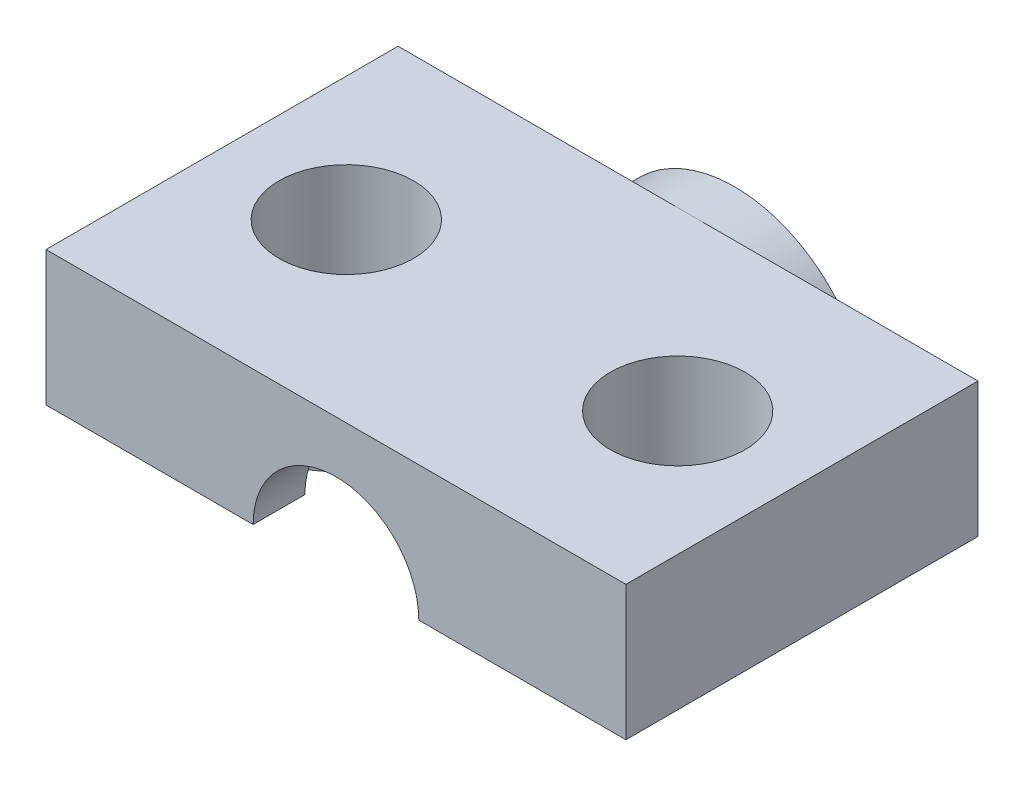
ISO-10303-21;
HEADER;
FILE_DESCRIPTION(('STEP AP214'),'2;1');
FILE_NAME('part.step','',(''),(''),'','','');
FILE_SCHEMA(('AUTOMOTIVE_DESIGN { 1 0 10303 214 1 1 1 1 }'));
ENDSEC;
DATA;
#1=APPLICATION_CONTEXT('core data for automotive mechanical design processes');
#2=APPLICATION_PROTOCOL_DEFINITION('international standard','automotive_design',2000,#1);
#3=PRODUCT_CONTEXT('',#1,'mechanical');
#4=PRODUCT('Part','Part','',(#3));
#5=PRODUCT_RELATED_PRODUCT_CATEGORY('part','',(#4));
#6=PRODUCT_DEFINITION_FORMATION('','',#4);
#7=PRODUCT_DEFINITION_CONTEXT('part definition',#1,'design');
#8=PRODUCT_DEFINITION('design','',#6,#7);
#9=PRODUCT_DEFINITION_SHAPE('','',#8);
#10=(LENGTH_UNIT() NAMED_UNIT(*) SI_UNIT(.MILLI.,.METRE.));
#11=(NAMED_UNIT(*) PLANE_ANGLE_UNIT() SI_UNIT($,.RADIAN.));
#12=(NAMED_UNIT(*) SI_UNIT($,.STERADIAN.) SOLID_ANGLE_UNIT());
#13=UNCERTAINTY_MEASURE_WITH_UNIT(LENGTH_MEASURE(1.E-05),#10,'distance_accuracy_value','');
#14=(GEOMETRIC_REPRESENTATION_CONTEXT(3) GLOBAL_UNCERTAINTY_ASSIGNED_CONTEXT((#13)) GLOBAL_UNIT_ASSIGNED_CONTEXT((#10,
#11,#12)) REPRESENTATION_CONTEXT('',''));
#15=CARTESIAN_POINT('',(0.,0.,0.));
#16=DIRECTION('',(0.,0.,1.));
#17=DIRECTION('',(1.,0.,0.));
#18=AXIS2_PLACEMENT_3D('',#15,#16,#17);
#19=CARTESIAN_POINT('',(-14.,6.5,-8.5));
#20=DIRECTION('',(0.,0.,1.));
#21=DIRECTION('',(1.,0.,0.));
#22=AXIS2_PLACEMENT_3D('',#19,#20,#21);
#23=PLANE('',#22);
#24=CARTESIAN_POINT('',(0.,0.,-8.5));
#25=DIRECTION('',(0.,0.,-1.));
#26=DIRECTION('',(-1.,0.,0.));
#27=AXIS2_PLACEMENT_3D('',#24,#25,#26);
#28=CIRCLE('',#27,6.5);
#29=CARTESIAN_POINT('',(-6.5,0.,-8.5));
#30=VERTEX_POINT('',#29);
#31=CARTESIAN_POINT('',(0.,6.5,-8.5));
#32=VERTEX_POINT('',#31);
#33=EDGE_CURVE('E46',#30,#32,#28,.T.);
#34=ORIENTED_EDGE('',*,*,#33,.F.);
#35=DIRECTION('',(-1.,0.,0.));
#36=VECTOR('',#35,1.);
#37=CARTESIAN_POINT('',(-14.,0.,-8.5));
#38=LINE('',#37,#36);
#39=CARTESIAN_POINT('',(-14.,0.,-8.5));
#40=VERTEX_POINT('',#39);
#41=EDGE_CURVE('E373',#30,#40,#38,.T.);
#42=ORIENTED_EDGE('',*,*,#41,.T.);
#43=DIRECTION('',(0.,-1.,0.));
#44=VECTOR('',#43,1.);
#45=CARTESIAN_POINT('',(-14.,6.5,-8.5));
#46=LINE('',#45,#44);
#47=CARTESIAN_POINT('',(-14.,6.5,-8.5));
#48=VERTEX_POINT('',#47);
#49=EDGE_CURVE('E396',#48,#40,#46,.T.);
#50=ORIENTED_EDGE('',*,*,#49,.F.);
#51=DIRECTION('',(-1.,0.,0.));
#52=VECTOR('',#51,1.);
#53=CARTESIAN_POINT('',(-14.,6.5,-8.5));
#54=LINE('',#53,#52);
#55=EDGE_CURVE('E508',#32,#48,#54,.T.);
#56=ORIENTED_EDGE('',*,*,#55,.F.);
#57=EDGE_LOOP('',(#34,#42,#50,#56));
#58=FACE_BOUND('',#57,.T.);
#59=ADVANCED_FACE('F35',(#58),#23,.F.);
#60=CARTESIAN_POINT('',(0.,0.,0.));
#61=DIRECTION('',(0.,1.,0.));
#62=DIRECTION('',(0.,0.,1.));
#63=AXIS2_PLACEMENT_3D('',#60,#61,#62);
#64=PLANE('',#63);
#65=CARTESIAN_POINT('',(-8.,0.,0.));
#66=DIRECTION('',(0.,-1.,0.));
#67=DIRECTION('',(0.,0.,-1.));
#68=AXIS2_PLACEMENT_3D('',#65,#66,#67);
#69=CIRCLE('',#68,3.25);
#70=CARTESIAN_POINT('',(-8.,0.,-3.25));
#71=VERTEX_POINT('',#70);
#72=EDGE_CURVE('E379',#71,#71,#69,.T.);
#73=ORIENTED_EDGE('',*,*,#72,.F.);
#74=EDGE_LOOP('',(#73));
#75=FACE_BOUND('',#74,.T.);
#76=ORIENTED_EDGE('',*,*,#41,.F.);
#77=DIRECTION('',(0.,0.,1.));
#78=VECTOR('',#77,1.);
#79=CARTESIAN_POINT('',(-6.5,0.,-10.75));
#80=LINE('',#79,#78);
#81=CARTESIAN_POINT('',(-6.5,0.,-10.75));
#82=VERTEX_POINT('',#81);
#83=EDGE_CURVE('E228',#82,#30,#80,.T.);
#84=ORIENTED_EDGE('',*,*,#83,.F.);
#85=DIRECTION('',(-1.,0.,0.));
#86=VECTOR('',#85,1.);
#87=CARTESIAN_POINT('',(-6.5,0.,-10.75));
#88=LINE('',#87,#86);
#89=CARTESIAN_POINT('',(-4.,0.,-10.75));
#90=VERTEX_POINT('',#89);
#91=EDGE_CURVE('E225',#90,#82,#88,.T.);
#92=ORIENTED_EDGE('',*,*,#91,.F.);
#93=DIRECTION('',(0.,0.,1.));
#94=VECTOR('',#93,1.);
#95=CARTESIAN_POINT('',(-4.,0.,-8.5));
#96=LINE('',#95,#94);
#97=CARTESIAN_POINT('',(-4.,0.,-6.));
#98=VERTEX_POINT('',#97);
#99=EDGE_CURVE('E211',#90,#98,#96,.T.);
#100=ORIENTED_EDGE('',*,*,#99,.T.);
#101=DIRECTION('',(-1.,0.,0.));
#102=VECTOR('',#101,1.);
#103=CARTESIAN_POINT('',(-14.,0.,-6.));
#104=LINE('',#103,#102);
#105=CARTESIAN_POINT('',(-11.5,0.,-6.));
#106=VERTEX_POINT('',#105);
#107=EDGE_CURVE('E471',#98,#106,#104,.T.);
#108=ORIENTED_EDGE('',*,*,#107,.T.);
#109=DIRECTION('',(0.,0.,1.));
#110=VECTOR('',#109,1.);
#111=CARTESIAN_POINT('',(-11.5,0.,-8.5));
#112=LINE('',#111,#110);
#113=CARTESIAN_POINT('',(-11.5,0.,-4.56207189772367));
#114=VERTEX_POINT('',#113);
#115=EDGE_CURVE('E479',#106,#114,#112,.T.);
#116=ORIENTED_EDGE('',*,*,#115,.T.);
#117=CARTESIAN_POINT('',(-8.,0.,0.));
#118=DIRECTION('',(0.,1.,0.));
#119=DIRECTION('',(0.,0.,1.));
#120=AXIS2_PLACEMENT_3D('',#117,#118,#119);
#121=CIRCLE('',#120,5.75);
#122=CARTESIAN_POINT('',(-4.,0.,-4.13067791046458));
#123=VERTEX_POINT('',#122);
#124=EDGE_CURVE('E486',#114,#123,#121,.F.);
#125=ORIENTED_EDGE('',*,*,#124,.T.);
#126=CARTESIAN_POINT('',(-4.,0.,4.13067791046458));
#127=VERTEX_POINT('',#126);
#128=EDGE_CURVE('E222',#123,#127,#96,.T.);
#129=ORIENTED_EDGE('',*,*,#128,.T.);
#130=CARTESIAN_POINT('',(-11.5,0.,4.56207189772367));
#131=VERTEX_POINT('',#130);
#132=EDGE_CURVE('E466',#127,#131,#121,.F.);
#133=ORIENTED_EDGE('',*,*,#132,.T.);
#134=CARTESIAN_POINT('',(-11.5,0.,6.));
#135=VERTEX_POINT('',#134);
#136=EDGE_CURVE('E476',#131,#135,#112,.T.);
#137=ORIENTED_EDGE('',*,*,#136,.T.);
#138=DIRECTION('',(1.,0.,0.));
#139=VECTOR('',#138,1.);
#140=CARTESIAN_POINT('',(-14.,0.,6.));
#141=LINE('',#140,#139);
#142=CARTESIAN_POINT('',(-4.,0.,6.));
#143=VERTEX_POINT('',#142);
#144=EDGE_CURVE('E472',#135,#143,#141,.T.);
#145=ORIENTED_EDGE('',*,*,#144,.T.);
#146=CARTESIAN_POINT('',(-4.,0.,8.5));
#147=VERTEX_POINT('',#146);
#148=EDGE_CURVE('E223',#143,#147,#96,.T.);
#149=ORIENTED_EDGE('',*,*,#148,.T.);
#150=DIRECTION('',(1.,0.,0.));
#151=VECTOR('',#150,1.);
#152=CARTESIAN_POINT('',(-14.,0.,8.5));
#153=LINE('',#152,#151);
#154=CARTESIAN_POINT('',(-14.,0.,8.5));
#155=VERTEX_POINT('',#154);
#156=EDGE_CURVE('E388',#155,#147,#153,.T.);
#157=ORIENTED_EDGE('',*,*,#156,.F.);
#158=DIRECTION('',(0.,0.,1.));
#159=VECTOR('',#158,1.);
#160=CARTESIAN_POINT('',(-14.,0.,-8.5));
#161=LINE('',#160,#159);
#162=EDGE_CURVE('E385',#40,#155,#161,.T.);
#163=ORIENTED_EDGE('',*,*,#162,.F.);
#164=EDGE_LOOP('',(#76,#84,#92,#100,#108,#116,#125,#129,#133,#137,#145,#149,#157,#163));
#165=FACE_BOUND('',#164,.T.);
#166=ADVANCED_FACE('F226',(#75,#165),#64,.F.);
#167=CARTESIAN_POINT('',(-14.,6.5,-6.));
#168=DIRECTION('',(0.,0.,1.));
#169=DIRECTION('',(1.,0.,0.));
#170=AXIS2_PLACEMENT_3D('',#167,#168,#169);
#171=PLANE('',#170);
#172=CARTESIAN_POINT('',(0.,0.,-6.));
#173=DIRECTION('',(0.,0.,1.));
#174=DIRECTION('',(1.,0.,0.));
#175=AXIS2_PLACEMENT_3D('',#172,#173,#174);
#176=CIRCLE('',#175,4.);
#177=CARTESIAN_POINT('',(4.,0.,-6.));
#178=VERTEX_POINT('',#177);
#179=CARTESIAN_POINT('',(0.,4.,-6.));
#180=VERTEX_POINT('',#179);
#181=EDGE_CURVE('E548',#178,#180,#176,.T.);
#182=ORIENTED_EDGE('',*,*,#181,.F.);
#183=CARTESIAN_POINT('',(11.5,0.,-6.));
#184=VERTEX_POINT('',#183);
#185=EDGE_CURVE('E480',#184,#178,#104,.T.);
#186=ORIENTED_EDGE('',*,*,#185,.F.);
#187=DIRECTION('',(0.,-1.,0.));
#188=VECTOR('',#187,1.);
#189=CARTESIAN_POINT('',(11.5,6.5,-6.));
#190=LINE('',#189,#188);
#191=CARTESIAN_POINT('',(11.5,4.,-6.));
#192=VERTEX_POINT('',#191);
#193=EDGE_CURVE('E432',#192,#184,#190,.T.);
#194=ORIENTED_EDGE('',*,*,#193,.F.);
#195=DIRECTION('',(-1.,0.,0.));
#196=VECTOR('',#195,1.);
#197=CARTESIAN_POINT('',(-14.,4.,-6.));
#198=LINE('',#197,#196);
#199=EDGE_CURVE('E449',#192,#180,#198,.T.);
#200=ORIENTED_EDGE('',*,*,#199,.T.);
#201=EDGE_LOOP('',(#182,#186,#194,#200));
#202=FACE_BOUND('',#201,.T.);
#203=ADVANCED_FACE('F321',(#202),#171,.T.);
#204=CARTESIAN_POINT('',(-14.,6.5,6.));
#205=DIRECTION('',(0.,0.,-1.));
#206=DIRECTION('',(-1.,0.,0.));
#207=AXIS2_PLACEMENT_3D('',#204,#205,#206);
#208=PLANE('',#207);
#209=CARTESIAN_POINT('',(0.,0.,6.));
#210=DIRECTION('',(0.,0.,-1.));
#211=DIRECTION('',(-1.,0.,0.));
#212=AXIS2_PLACEMENT_3D('',#209,#210,#211);
#213=CIRCLE('',#212,4.);
#214=CARTESIAN_POINT('',(0.,4.,6.));
#215=VERTEX_POINT('',#214);
#216=EDGE_CURVE('E526',#143,#215,#213,.T.);
#217=ORIENTED_EDGE('',*,*,#216,.F.);
#218=ORIENTED_EDGE('',*,*,#144,.F.);
#219=DIRECTION('',(0.,-1.,0.));
#220=VECTOR('',#219,1.);
#221=CARTESIAN_POINT('',(-11.5,6.5,6.));
#222=LINE('',#221,#220);
#223=CARTESIAN_POINT('',(-11.5,4.,6.));
#224=VERTEX_POINT('',#223);
#225=EDGE_CURVE('E445',#224,#135,#222,.T.);
#226=ORIENTED_EDGE('',*,*,#225,.F.);
#227=DIRECTION('',(1.,0.,0.));
#228=VECTOR('',#227,1.);
#229=CARTESIAN_POINT('',(-14.,4.,6.));
#230=LINE('',#229,#228);
#231=EDGE_CURVE('E446',#224,#215,#230,.T.);
#232=ORIENTED_EDGE('',*,*,#231,.T.);
#233=EDGE_LOOP('',(#217,#218,#226,#232));
#234=FACE_BOUND('',#233,.T.);
#235=ADVANCED_FACE('F311',(#234),#208,.T.);
#236=CARTESIAN_POINT('',(-2.38751391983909,-5.3898878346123,-1.25));
#237=DIRECTION('',(0.,0.,1.));
#238=DIRECTION('',(1.,0.,0.));
#239=AXIS2_PLACEMENT_3D('',#236,#237,#238);
#240=PLANE('',#239);
#241=DIRECTION('',(0.,1.,0.));
#242=VECTOR('',#241,1.);
#243=CARTESIAN_POINT('',(2.38751391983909,-5.3898878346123,-1.25));
#244=LINE('',#243,#242);
#245=CARTESIAN_POINT('',(2.38751391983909,3.20932660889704,-1.25));
#246=VERTEX_POINT('',#245);
#247=CARTESIAN_POINT('',(2.38751391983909,4.,-1.25));
#248=VERTEX_POINT('',#247);
#249=EDGE_CURVE('E424',#246,#248,#244,.T.);
#250=ORIENTED_EDGE('',*,*,#249,.F.);
#251=CARTESIAN_POINT('',(0.,0.,-1.25));
#252=DIRECTION('',(0.,0.,1.));
#253=DIRECTION('',(1.,0.,0.));
#254=AXIS2_PLACEMENT_3D('',#251,#252,#253);
#255=CIRCLE('',#254,4.);
#256=CARTESIAN_POINT('',(0.,4.,-1.25));
#257=VERTEX_POINT('',#256);
#258=EDGE_CURVE('E551',#246,#257,#255,.T.);
#259=ORIENTED_EDGE('',*,*,#258,.T.);
#260=DIRECTION('',(1.,0.,0.));
#261=VECTOR('',#260,1.);
#262=CARTESIAN_POINT('',(-2.38751391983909,4.,-1.25));
#263=LINE('',#262,#261);
#264=EDGE_CURVE('E418',#257,#248,#263,.T.);
#265=ORIENTED_EDGE('',*,*,#264,.T.);
#266=EDGE_LOOP('',(#250,#259,#265));
#267=FACE_BOUND('',#266,.T.);
#268=ADVANCED_FACE('F334',(#267),#240,.F.);
#269=CARTESIAN_POINT('',(-2.38751391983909,-5.3898878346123,1.25));
#270=DIRECTION('',(0.,0.,-1.));
#271=DIRECTION('',(-1.,0.,0.));
#272=AXIS2_PLACEMENT_3D('',#269,#270,#271);
#273=PLANE('',#272);
#274=DIRECTION('',(0.,1.,0.));
#275=VECTOR('',#274,1.);
#276=CARTESIAN_POINT('',(-2.38751391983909,-5.3898878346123,1.25));
#277=LINE('',#276,#275);
#278=CARTESIAN_POINT('',(-2.38751391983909,3.20932660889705,1.25));
#279=VERTEX_POINT('',#278);
#280=CARTESIAN_POINT('',(-2.38751391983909,4.,1.25));
#281=VERTEX_POINT('',#280);
#282=EDGE_CURVE('E405',#279,#281,#277,.T.);
#283=ORIENTED_EDGE('',*,*,#282,.F.);
#284=CARTESIAN_POINT('',(0.,0.,1.25));
#285=DIRECTION('',(0.,0.,-1.));
#286=DIRECTION('',(-1.,0.,0.));
#287=AXIS2_PLACEMENT_3D('',#284,#285,#286);
#288=CIRCLE('',#287,4.);
#289=CARTESIAN_POINT('',(0.,4.,1.25));
#290=VERTEX_POINT('',#289);
#291=EDGE_CURVE('E44',#279,#290,#288,.T.);
#292=ORIENTED_EDGE('',*,*,#291,.T.);
#293=DIRECTION('',(-1.,0.,0.));
#294=VECTOR('',#293,1.);
#295=CARTESIAN_POINT('',(-2.38751391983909,4.,1.25));
#296=LINE('',#295,#294);
#297=EDGE_CURVE('E403',#290,#281,#296,.T.);
#298=ORIENTED_EDGE('',*,*,#297,.T.);
#299=EDGE_LOOP('',(#283,#292,#298));
#300=FACE_BOUND('',#299,.T.);
#301=ADVANCED_FACE('F304',(#300),#273,.F.);
#302=CARTESIAN_POINT('',(0.,4.,0.));
#303=DIRECTION('',(0.,1.,0.));
#304=DIRECTION('',(0.,0.,1.));
#305=AXIS2_PLACEMENT_3D('',#302,#303,#304);
#306=PLANE('',#305);
#307=CARTESIAN_POINT('',(-11.5,4.,-6.));
#308=VERTEX_POINT('',#307);
#309=EDGE_CURVE('E440',#180,#308,#198,.T.);
#310=ORIENTED_EDGE('',*,*,#309,.F.);
#311=ORIENTED_EDGE('',*,*,#199,.F.);
#312=DIRECTION('',(0.,0.,-1.));
#313=VECTOR('',#312,1.);
#314=CARTESIAN_POINT('',(11.5,4.,-8.5));
#315=LINE('',#314,#313);
#316=CARTESIAN_POINT('',(11.5,4.,-4.56207189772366));
#317=VERTEX_POINT('',#316);
#318=EDGE_CURVE('E441',#317,#192,#315,.T.);
#319=ORIENTED_EDGE('',*,*,#318,.F.);
#320=CARTESIAN_POINT('',(8.,4.,0.));
#321=DIRECTION('',(0.,1.,0.));
#322=DIRECTION('',(0.,0.,1.));
#323=AXIS2_PLACEMENT_3D('',#320,#321,#322);
#324=CIRCLE('',#323,5.75);
#325=EDGE_CURVE('E467',#248,#317,#324,.F.);
#326=ORIENTED_EDGE('',*,*,#325,.F.);
#327=ORIENTED_EDGE('',*,*,#264,.F.);
#328=CARTESIAN_POINT('',(-2.38751391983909,4.,-1.25));
#329=VERTEX_POINT('',#328);
#330=EDGE_CURVE('E419',#329,#257,#263,.T.);
#331=ORIENTED_EDGE('',*,*,#330,.F.);
#332=CARTESIAN_POINT('',(-8.,4.,0.));
#333=DIRECTION('',(0.,1.,0.));
#334=DIRECTION('',(0.,0.,1.));
#335=AXIS2_PLACEMENT_3D('',#332,#333,#334);
#336=CIRCLE('',#335,5.75);
#337=CARTESIAN_POINT('',(-11.5,4.,-4.56207189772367));
#338=VERTEX_POINT('',#337);
#339=EDGE_CURVE('E460',#338,#329,#336,.F.);
#340=ORIENTED_EDGE('',*,*,#339,.F.);
#341=DIRECTION('',(0.,0.,1.));
#342=VECTOR('',#341,1.);
#343=CARTESIAN_POINT('',(-11.5,4.,-8.5));
#344=LINE('',#343,#342);
#345=EDGE_CURVE('E454',#308,#338,#344,.T.);
#346=ORIENTED_EDGE('',*,*,#345,.F.);
#347=EDGE_LOOP('',(#310,#311,#319,#326,#327,#331,#340,#346));
#348=FACE_BOUND('',#347,.T.);
#349=ADVANCED_FACE('F300',(#348),#306,.F.);
#350=ORIENTED_EDGE('',*,*,#297,.F.);
#351=CARTESIAN_POINT('',(2.38751391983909,4.,1.25));
#352=VERTEX_POINT('',#351);
#353=EDGE_CURVE('E411',#352,#290,#296,.T.);
#354=ORIENTED_EDGE('',*,*,#353,.F.);
#355=CARTESIAN_POINT('',(11.5,4.,4.56207189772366));
#356=VERTEX_POINT('',#355);
#357=EDGE_CURVE('E464',#356,#352,#324,.F.);
#358=ORIENTED_EDGE('',*,*,#357,.F.);
#359=CARTESIAN_POINT('',(11.5,4.,6.));
#360=VERTEX_POINT('',#359);
#361=EDGE_CURVE('E437',#360,#356,#315,.T.);
#362=ORIENTED_EDGE('',*,*,#361,.F.);
#363=EDGE_CURVE('E457',#215,#360,#230,.T.);
#364=ORIENTED_EDGE('',*,*,#363,.F.);
#365=ORIENTED_EDGE('',*,*,#231,.F.);
#366=CARTESIAN_POINT('',(-11.5,4.,4.56207189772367));
#367=VERTEX_POINT('',#366);
#368=EDGE_CURVE('E452',#367,#224,#344,.T.);
#369=ORIENTED_EDGE('',*,*,#368,.F.);
#370=EDGE_CURVE('E414',#281,#367,#336,.F.);
#371=ORIENTED_EDGE('',*,*,#370,.F.);
#372=EDGE_LOOP('',(#350,#354,#358,#362,#364,#365,#369,#371));
#373=FACE_BOUND('',#372,.T.);
#374=ADVANCED_FACE('F298',(#373),#306,.F.);
#375=CARTESIAN_POINT('',(8.,6.5,0.));
#376=DIRECTION('',(0.,-1.,0.));
#377=DIRECTION('',(0.,0.,-1.));
#378=AXIS2_PLACEMENT_3D('',#375,#376,#377);
#379=CYLINDRICAL_SURFACE('',#378,5.75);
#380=CARTESIAN_POINT('',(2.38751391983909,3.20932660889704,-1.25));
#381=CARTESIAN_POINT('',(2.41123173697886,3.19165071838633,-1.35658913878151));
#382=CARTESIAN_POINT('',(2.43794085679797,3.1714021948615,-1.46211106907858));
#383=CARTESIAN_POINT('',(2.49691718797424,3.12519817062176,-1.67040124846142));
#384=CARTESIAN_POINT('',(2.52918864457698,3.09923830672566,-1.77316732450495));
#385=CARTESIAN_POINT('',(2.59911081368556,3.04083861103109,-1.97598302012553));
#386=CARTESIAN_POINT('',(2.63680317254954,3.00834775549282,-2.07600372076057));
#387=CARTESIAN_POINT('',(2.7166918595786,2.93640547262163,-2.27163149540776));
#388=CARTESIAN_POINT('',(2.75888717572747,2.89695560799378,-2.36723955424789));
#389=CARTESIAN_POINT('',(2.84721821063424,2.81019626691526,-2.55383301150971));
#390=CARTESIAN_POINT('',(2.893377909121,2.76283704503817,-2.64478406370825));
#391=CARTESIAN_POINT('',(2.98827746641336,2.65990488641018,-2.82047915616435));
#392=CARTESIAN_POINT('',(3.03701686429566,2.60433341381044,-2.90522429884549));
#393=CARTESIAN_POINT('',(3.13552910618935,2.48483905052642,-3.06730845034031));
#394=CARTESIAN_POINT('',(3.18529682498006,2.42095175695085,-3.14467672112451));
#395=CARTESIAN_POINT('',(3.28451668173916,2.28452517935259,-3.29159125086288));
#396=CARTESIAN_POINT('',(3.33396889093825,2.21198792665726,-3.36113933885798));
#397=CARTESIAN_POINT('',(3.42423068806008,2.06900418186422,-3.48278111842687));
#398=CARTESIAN_POINT('',(3.46529436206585,1.9996391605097,-3.53596012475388));
#399=CARTESIAN_POINT('',(3.54485750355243,1.85493874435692,-3.63569453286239));
#400=CARTESIAN_POINT('',(3.58335738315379,1.77960431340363,-3.68225100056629));
#401=CARTESIAN_POINT('',(3.65678249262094,1.62339063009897,-3.76857785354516));
#402=CARTESIAN_POINT('',(3.69170435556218,1.54250627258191,-3.80834187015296));
#403=CARTESIAN_POINT('',(3.75697074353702,1.37592468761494,-3.88092613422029));
#404=CARTESIAN_POINT('',(3.78731592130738,1.2902281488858,-3.91374737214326));
#405=CARTESIAN_POINT('',(3.83897853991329,1.12633491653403,-3.9685799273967));
#406=CARTESIAN_POINT('',(3.86095813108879,1.04863016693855,-3.99144465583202));
#407=CARTESIAN_POINT('',(3.90040627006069,0.890757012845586,-4.03195135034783));
#408=CARTESIAN_POINT('',(3.9178752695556,0.810588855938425,-4.04959383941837));
#409=CARTESIAN_POINT('',(3.94793121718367,0.648550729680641,-4.07966786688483));
#410=CARTESIAN_POINT('',(3.96052748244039,0.566684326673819,-4.09210935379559));
#411=CARTESIAN_POINT('',(3.98063923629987,0.401753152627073,-4.11186566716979));
#412=CARTESIAN_POINT('',(3.98815760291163,0.318689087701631,-4.11918339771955));
#413=CARTESIAN_POINT('',(3.99537924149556,0.1961809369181,-4.12619932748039));
#414=CARTESIAN_POINT('',(3.99711260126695,0.156951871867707,-4.12788032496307));
#415=CARTESIAN_POINT('',(3.99942228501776,0.0784835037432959,-4.13011859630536));
#416=CARTESIAN_POINT('',(4.00000024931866,0.0392442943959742,-4.13067746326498));
#417=CARTESIAN_POINT('',(4.,0.,-4.13067791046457));
#418=B_SPLINE_CURVE_WITH_KNOTS('',3,(#380,#381,#382,#383,#384,#385,#386,#387,#388,#389,#390,
#391,#392,#393,#394,#395,#396,#397,#398,#399,#400,#401,#402,#403,#404,#405,#406,#407,#408,#409,
#410,#411,#412,#413,#414,#415,#416,#417),.UNSPECIFIED.,.F.,.F.,(4,2,2,2,2,2,2,2,2,2,2,2,2,2,2,2,
2,2,4),(0.,0.331813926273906,0.66388222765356,0.998653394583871,1.33334948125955,
1.67023588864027,2.00706230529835,2.34249159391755,2.67784226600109,2.96712839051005,
3.25636790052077,3.54587713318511,3.83534503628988,4.08681946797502,4.33826870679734,
4.58923474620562,4.8400584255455,4.95794039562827,5.07565488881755),.UNSPECIFIED.);
#419=CARTESIAN_POINT('',(4.,0.,-4.13067791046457));
#420=VERTEX_POINT('',#419);
#421=EDGE_CURVE('E285',#246,#420,#418,.T.);
#422=ORIENTED_EDGE('',*,*,#421,.F.);
#423=ORIENTED_EDGE('',*,*,#249,.T.);
#424=ORIENTED_EDGE('',*,*,#325,.T.);
#425=DIRECTION('',(0.,-1.,0.));
#426=VECTOR('',#425,1.);
#427=CARTESIAN_POINT('',(11.5,6.5,-4.56207189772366));
#428=LINE('',#427,#426);
#429=CARTESIAN_POINT('',(11.5,0.,-4.56207189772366));
#430=VERTEX_POINT('',#429);
#431=EDGE_CURVE('E435',#430,#317,#428,.F.);
#432=ORIENTED_EDGE('',*,*,#431,.F.);
#433=CARTESIAN_POINT('',(8.,0.,0.));
#434=DIRECTION('',(0.,1.,0.));
#435=DIRECTION('',(0.,0.,1.));
#436=AXIS2_PLACEMENT_3D('',#433,#434,#435);
#437=CIRCLE('',#436,5.75);
#438=EDGE_CURVE('E431',#420,#430,#437,.F.);
#439=ORIENTED_EDGE('',*,*,#438,.F.);
#440=EDGE_LOOP('',(#422,#423,#424,#432,#439));
#441=FACE_BOUND('',#440,.T.);
#442=ADVANCED_FACE('F293',(#441),#379,.T.);
#443=CARTESIAN_POINT('',(4.,0.,4.13067791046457));
#444=CARTESIAN_POINT('',(4.00001635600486,0.0820966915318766,4.13067473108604));
#445=CARTESIAN_POINT('',(3.99747317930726,0.164191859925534,4.12823043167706));
#446=CARTESIAN_POINT('',(3.9873855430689,0.327774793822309,4.118436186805));
#447=CARTESIAN_POINT('',(3.97984141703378,0.409262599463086,4.11108656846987));
#448=CARTESIAN_POINT('',(3.95988659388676,0.570900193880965,4.09147495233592));
#449=CARTESIAN_POINT('',(3.94748418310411,0.651052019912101,4.07922131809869));
#450=CARTESIAN_POINT('',(3.91804668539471,0.80957255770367,4.04976459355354));
#451=CARTESIAN_POINT('',(3.90101167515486,0.88794129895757,4.03256158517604));
#452=CARTESIAN_POINT('',(3.86261560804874,1.04236733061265,3.99315735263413));
#453=CARTESIAN_POINT('',(3.8412528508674,1.11842369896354,3.97095416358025));
#454=CARTESIAN_POINT('',(3.79462141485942,1.26766603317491,3.92153598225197));
#455=CARTESIAN_POINT('',(3.76935127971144,1.3408509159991,3.89431912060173));
#456=CARTESIAN_POINT('',(3.68842426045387,1.55523382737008,3.80516228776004));
#457=CARTESIAN_POINT('',(3.62759637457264,1.69147176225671,3.73566289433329));
#458=CARTESIAN_POINT('',(3.49706983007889,1.9470899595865,3.57723325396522));
#459=CARTESIAN_POINT('',(3.42737569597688,2.06647875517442,3.48831290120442));
#460=CARTESIAN_POINT('',(3.2844165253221,2.28689294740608,3.29248323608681));
#461=CARTESIAN_POINT('',(3.21115117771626,2.38791674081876,3.18557235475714));
#462=CARTESIAN_POINT('',(3.06112841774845,2.57782388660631,2.9480678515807));
#463=CARTESIAN_POINT('',(2.98448320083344,2.66537158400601,2.8163433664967));
#464=CARTESIAN_POINT('',(2.8380551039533,2.82079719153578,2.53802620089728));
#465=CARTESIAN_POINT('',(2.76828350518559,2.88864311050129,2.39140985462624));
#466=CARTESIAN_POINT('',(2.67104192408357,2.97783694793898,2.16145512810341));
#467=CARTESIAN_POINT('',(2.63956527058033,3.00570285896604,2.08221731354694));
#468=CARTESIAN_POINT('',(2.57976751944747,3.05718137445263,1.92118305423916));
#469=CARTESIAN_POINT('',(2.55144680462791,3.08079346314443,1.83938630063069));
#470=CARTESIAN_POINT('',(2.49837719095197,3.12398514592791,1.67396616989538));
#471=CARTESIAN_POINT('',(2.473615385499,3.14357942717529,1.59035072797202));
#472=CARTESIAN_POINT('',(2.42776236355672,3.17911748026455,1.42139031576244));
#473=CARTESIAN_POINT('',(2.40666974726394,3.19506264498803,1.33604601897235));
#474=CARTESIAN_POINT('',(2.38751391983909,3.20932660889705,1.25000000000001));
#475=B_SPLINE_CURVE_WITH_KNOTS('',3,(#443,#444,#445,#446,#447,#448,#449,#450,#451,#452,#453,
#454,#455,#456,#457,#458,#459,#460,#461,#462,#463,#464,#465,#466,#467,#468,#469,#470,#471,#472,
#473,#474),.UNSPECIFIED.,.F.,.F.,(4,2,2,2,2,2,2,2,2,2,2,2,2,2,2,4),(0.,0.246212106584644,
0.492407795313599,0.738185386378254,0.983958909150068,1.22982918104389,1.47579131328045,
1.96704954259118,2.45805807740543,2.94910945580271,3.47436245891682,4.00046364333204,
4.26940354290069,4.53837602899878,4.80634702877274,5.07421557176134),.UNSPECIFIED.);
#476=CARTESIAN_POINT('',(4.,0.,4.13067791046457));
#477=VERTEX_POINT('',#476);
#478=CARTESIAN_POINT('',(2.38751391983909,3.20932660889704,1.25));
#479=VERTEX_POINT('',#478);
#480=EDGE_CURVE('E255',#477,#479,#475,.T.);
#481=ORIENTED_EDGE('',*,*,#480,.F.);
#482=CARTESIAN_POINT('',(11.5,0.,4.56207189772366));
#483=VERTEX_POINT('',#482);
#484=EDGE_CURVE('E483',#483,#477,#437,.F.);
#485=ORIENTED_EDGE('',*,*,#484,.F.);
#486=DIRECTION('',(0.,-1.,0.));
#487=VECTOR('',#486,1.);
#488=CARTESIAN_POINT('',(11.5,6.5,4.56207189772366));
#489=LINE('',#488,#487);
#490=EDGE_CURVE('E491',#483,#356,#489,.F.);
#491=ORIENTED_EDGE('',*,*,#490,.T.);
#492=ORIENTED_EDGE('',*,*,#357,.T.);
#493=DIRECTION('',(0.,1.,0.));
#494=VECTOR('',#493,1.);
#495=CARTESIAN_POINT('',(2.38751391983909,-5.3898878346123,1.25));
#496=LINE('',#495,#494);
#497=EDGE_CURVE('E417',#479,#352,#496,.T.);
#498=ORIENTED_EDGE('',*,*,#497,.F.);
#499=EDGE_LOOP('',(#481,#485,#491,#492,#498));
#500=FACE_BOUND('',#499,.T.);
#501=ADVANCED_FACE('F297',(#500),#379,.T.);
#502=CARTESIAN_POINT('',(-8.,6.5,0.));
#503=DIRECTION('',(0.,-1.,0.));
#504=DIRECTION('',(0.,0.,-1.));
#505=AXIS2_PLACEMENT_3D('',#502,#503,#504);
#506=CYLINDRICAL_SURFACE('',#505,5.75);
#507=CARTESIAN_POINT('',(-4.,0.,-4.13067791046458));
#508=CARTESIAN_POINT('',(-4.00001635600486,0.0820966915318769,-4.13067473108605));
#509=CARTESIAN_POINT('',(-3.99747317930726,0.164191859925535,-4.12823043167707));
#510=CARTESIAN_POINT('',(-3.98738554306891,0.32777479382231,-4.11843618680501));
#511=CARTESIAN_POINT('',(-3.97984141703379,0.409262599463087,-4.11108656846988));
#512=CARTESIAN_POINT('',(-3.95988659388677,0.570900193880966,-4.09147495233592));
#513=CARTESIAN_POINT('',(-3.94748418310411,0.651052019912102,-4.0792213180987));
#514=CARTESIAN_POINT('',(-3.91804668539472,0.809572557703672,-4.04976459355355));
#515=CARTESIAN_POINT('',(-3.90101167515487,0.887941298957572,-4.03256158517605));
#516=CARTESIAN_POINT('',(-3.86261560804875,1.04236733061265,-3.99315735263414));
#517=CARTESIAN_POINT('',(-3.8412528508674,1.11842369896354,-3.97095416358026));
#518=CARTESIAN_POINT('',(-3.79462141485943,1.26766603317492,-3.92153598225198));
#519=CARTESIAN_POINT('',(-3.76935127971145,1.3408509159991,-3.89431912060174));
#520=CARTESIAN_POINT('',(-3.68842426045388,1.55523382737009,-3.80516228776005));
#521=CARTESIAN_POINT('',(-3.62759637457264,1.69147176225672,-3.7356628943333));
#522=CARTESIAN_POINT('',(-3.4970698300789,1.9470899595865,-3.57723325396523));
#523=CARTESIAN_POINT('',(-3.42737569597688,2.06647875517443,-3.48831290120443));
#524=CARTESIAN_POINT('',(-3.2844165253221,2.28689294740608,-3.29248323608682));
#525=CARTESIAN_POINT('',(-3.21115117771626,2.38791674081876,-3.18557235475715));
#526=CARTESIAN_POINT('',(-3.06112841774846,2.57782388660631,-2.94806785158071));
#527=CARTESIAN_POINT('',(-2.98448320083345,2.66537158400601,-2.8163433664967));
#528=CARTESIAN_POINT('',(-2.83805510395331,2.82079719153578,-2.53802620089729));
#529=CARTESIAN_POINT('',(-2.76828350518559,2.8886431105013,-2.39140985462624));
#530=CARTESIAN_POINT('',(-2.67104192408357,2.97783694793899,-2.16145512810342));
#531=CARTESIAN_POINT('',(-2.63956527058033,3.00570285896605,-2.08221731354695));
#532=CARTESIAN_POINT('',(-2.57976751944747,3.05718137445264,-1.92118305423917));
#533=CARTESIAN_POINT('',(-2.55144680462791,3.08079346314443,-1.83938630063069));
#534=CARTESIAN_POINT('',(-2.49837719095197,3.12398514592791,-1.67396616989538));
#535=CARTESIAN_POINT('',(-2.473615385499,3.1435794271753,-1.59035072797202));
#536=CARTESIAN_POINT('',(-2.42776236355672,3.17911748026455,-1.42139031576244));
#537=CARTESIAN_POINT('',(-2.40666974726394,3.19506264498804,-1.33604601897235));
#538=CARTESIAN_POINT('',(-2.38751391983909,3.20932660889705,-1.25000000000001));
#539=B_SPLINE_CURVE_WITH_KNOTS('',3,(#507,#508,#509,#510,#511,#512,#513,#514,#515,#516,#517,
#518,#519,#520,#521,#522,#523,#524,#525,#526,#527,#528,#529,#530,#531,#532,#533,#534,#535,#536,
#537,#538),.UNSPECIFIED.,.F.,.F.,(4,2,2,2,2,2,2,2,2,2,2,2,2,2,2,4),(0.,0.246212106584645,
0.4924077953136,0.738185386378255,0.98395890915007,1.22982918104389,1.47579131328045,
1.96704954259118,2.45805807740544,2.94910945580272,3.47436245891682,4.00046364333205,
4.26940354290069,4.53837602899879,4.80634702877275,5.07421557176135),.UNSPECIFIED.);
#540=CARTESIAN_POINT('',(-2.38751391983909,3.20932660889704,-1.25));
#541=VERTEX_POINT('',#540);
#542=EDGE_CURVE('E280',#123,#541,#539,.T.);
#543=ORIENTED_EDGE('',*,*,#542,.F.);
#544=ORIENTED_EDGE('',*,*,#124,.F.);
#545=DIRECTION('',(0.,-1.,0.));
#546=VECTOR('',#545,1.);
#547=CARTESIAN_POINT('',(-11.5,6.5,-4.56207189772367));
#548=LINE('',#547,#546);
#549=EDGE_CURVE('E496',#114,#338,#548,.F.);
#550=ORIENTED_EDGE('',*,*,#549,.T.);
#551=ORIENTED_EDGE('',*,*,#339,.T.);
#552=DIRECTION('',(0.,1.,0.));
#553=VECTOR('',#552,1.);
#554=CARTESIAN_POINT('',(-2.38751391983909,-5.3898878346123,-1.25));
#555=LINE('',#554,#553);
#556=EDGE_CURVE('E427',#541,#329,#555,.T.);
#557=ORIENTED_EDGE('',*,*,#556,.F.);
#558=EDGE_LOOP('',(#543,#544,#550,#551,#557));
#559=FACE_BOUND('',#558,.T.);
#560=ADVANCED_FACE('F262',(#559),#506,.T.);
#561=CARTESIAN_POINT('',(-2.38751391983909,3.20932660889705,1.25));
#562=CARTESIAN_POINT('',(-2.41123173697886,3.19165071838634,1.35658913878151));
#563=CARTESIAN_POINT('',(-2.43794085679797,3.1714021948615,1.46211106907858));
#564=CARTESIAN_POINT('',(-2.49691718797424,3.12519817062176,1.67040124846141));
#565=CARTESIAN_POINT('',(-2.52918864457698,3.09923830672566,1.77316732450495));
#566=CARTESIAN_POINT('',(-2.59911081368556,3.0408386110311,1.97598302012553));
#567=CARTESIAN_POINT('',(-2.63680317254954,3.00834775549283,2.07600372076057));
#568=CARTESIAN_POINT('',(-2.7166918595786,2.93640547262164,2.27163149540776));
#569=CARTESIAN_POINT('',(-2.75888717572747,2.89695560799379,2.36723955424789));
#570=CARTESIAN_POINT('',(-2.84721821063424,2.81019626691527,2.55383301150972));
#571=CARTESIAN_POINT('',(-2.893377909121,2.76283704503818,2.64478406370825));
#572=CARTESIAN_POINT('',(-2.98827746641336,2.65990488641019,2.82047915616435));
#573=CARTESIAN_POINT('',(-3.03701686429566,2.60433341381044,2.90522429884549));
#574=CARTESIAN_POINT('',(-3.13552910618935,2.48483905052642,3.06730845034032));
#575=CARTESIAN_POINT('',(-3.18529682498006,2.42095175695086,3.14467672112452));
#576=CARTESIAN_POINT('',(-3.28451668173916,2.2845251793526,3.29159125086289));
#577=CARTESIAN_POINT('',(-3.33396889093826,2.21198792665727,3.36113933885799));
#578=CARTESIAN_POINT('',(-3.42423068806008,2.06900418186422,3.48278111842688));
#579=CARTESIAN_POINT('',(-3.46529436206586,1.99963916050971,3.53596012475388));
#580=CARTESIAN_POINT('',(-3.54485750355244,1.85493874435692,3.63569453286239));
#581=CARTESIAN_POINT('',(-3.5833573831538,1.77960431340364,3.6822510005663));
#582=CARTESIAN_POINT('',(-3.65678249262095,1.62339063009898,3.76857785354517));
#583=CARTESIAN_POINT('',(-3.69170435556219,1.54250627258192,3.80834187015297));
#584=CARTESIAN_POINT('',(-3.75697074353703,1.37592468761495,3.8809261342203));
#585=CARTESIAN_POINT('',(-3.78731592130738,1.29022814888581,3.91374737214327));
#586=CARTESIAN_POINT('',(-3.8389785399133,1.12633491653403,3.9685799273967));
#587=CARTESIAN_POINT('',(-3.86095813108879,1.04863016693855,3.99144465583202));
#588=CARTESIAN_POINT('',(-3.9004062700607,0.890757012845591,4.03195135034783));
#589=CARTESIAN_POINT('',(-3.9178752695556,0.81058885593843,4.04959383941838));
#590=CARTESIAN_POINT('',(-3.94793121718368,0.648550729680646,4.07966786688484));
#591=CARTESIAN_POINT('',(-3.96052748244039,0.566684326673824,4.09210935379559));
#592=CARTESIAN_POINT('',(-3.98063923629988,0.401753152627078,4.1118656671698));
#593=CARTESIAN_POINT('',(-3.98815760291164,0.318689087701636,4.11918339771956));
#594=CARTESIAN_POINT('',(-3.99537924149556,0.196180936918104,4.12619932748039));
#595=CARTESIAN_POINT('',(-3.99711260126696,0.15695187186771,4.12788032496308));
#596=CARTESIAN_POINT('',(-3.99942228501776,0.0784835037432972,4.13011859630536));
#597=CARTESIAN_POINT('',(-4.00000024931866,0.0392442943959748,4.13067746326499));
#598=CARTESIAN_POINT('',(-4.,0.,4.13067791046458));
#599=B_SPLINE_CURVE_WITH_KNOTS('',3,(#561,#562,#563,#564,#565,#566,#567,#568,#569,#570,#571,
#572,#573,#574,#575,#576,#577,#578,#579,#580,#581,#582,#583,#584,#585,#586,#587,#588,#589,#590,
#591,#592,#593,#594,#595,#596,#597,#598),.UNSPECIFIED.,.F.,.F.,(4,2,2,2,2,2,2,2,2,2,2,2,2,2,2,2,
2,2,4),(0.,0.331813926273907,0.663882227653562,0.998653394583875,1.33334948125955,
1.67023588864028,2.00706230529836,2.34249159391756,2.67784226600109,2.96712839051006,
3.25636790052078,3.54587713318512,3.83534503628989,4.08681946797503,4.33826870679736,
4.58923474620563,4.84005842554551,4.95794039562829,5.07565488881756),.UNSPECIFIED.);
#600=EDGE_CURVE('E247',#279,#127,#599,.T.);
#601=ORIENTED_EDGE('',*,*,#600,.F.);
#602=ORIENTED_EDGE('',*,*,#282,.T.);
#603=ORIENTED_EDGE('',*,*,#370,.T.);
#604=DIRECTION('',(0.,-1.,0.));
#605=VECTOR('',#604,1.);
#606=CARTESIAN_POINT('',(-11.5,6.5,4.56207189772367));
#607=LINE('',#606,#605);
#608=EDGE_CURVE('E493',#131,#367,#607,.F.);
#609=ORIENTED_EDGE('',*,*,#608,.F.);
#610=ORIENTED_EDGE('',*,*,#132,.F.);
#611=EDGE_LOOP('',(#601,#602,#603,#609,#610));
#612=FACE_BOUND('',#611,.T.);
#613=ADVANCED_FACE('F355',(#612),#506,.T.);
#614=CARTESIAN_POINT('',(14.,6.5,-8.5));
#615=DIRECTION('',(-1.,0.,0.));
#616=DIRECTION('',(0.,0.,1.));
#617=AXIS2_PLACEMENT_3D('',#614,#615,#616);
#618=PLANE('',#617);
#619=DIRECTION('',(0.,0.,-1.));
#620=VECTOR('',#619,1.);
#621=CARTESIAN_POINT('',(14.,0.,-8.5));
#622=LINE('',#621,#620);
#623=CARTESIAN_POINT('',(14.,0.,8.5));
#624=VERTEX_POINT('',#623);
#625=CARTESIAN_POINT('',(14.,0.,-8.5));
#626=VERTEX_POINT('',#625);
#627=EDGE_CURVE('E365',#624,#626,#622,.T.);
#628=ORIENTED_EDGE('',*,*,#627,.T.);
#629=DIRECTION('',(0.,-1.,0.));
#630=VECTOR('',#629,1.);
#631=CARTESIAN_POINT('',(14.,6.5,-8.5));
#632=LINE('',#631,#630);
#633=CARTESIAN_POINT('',(14.,6.5,-8.5));
#634=VERTEX_POINT('',#633);
#635=EDGE_CURVE('E368',#634,#626,#632,.T.);
#636=ORIENTED_EDGE('',*,*,#635,.F.);
#637=DIRECTION('',(0.,0.,-1.));
#638=VECTOR('',#637,1.);
#639=CARTESIAN_POINT('',(14.,6.5,-8.5));
#640=LINE('',#639,#638);
#641=CARTESIAN_POINT('',(14.,6.5,8.5));
#642=VERTEX_POINT('',#641);
#643=EDGE_CURVE('E391',#642,#634,#640,.T.);
#644=ORIENTED_EDGE('',*,*,#643,.F.);
#645=DIRECTION('',(0.,-1.,0.));
#646=VECTOR('',#645,1.);
#647=CARTESIAN_POINT('',(14.,6.5,8.5));
#648=LINE('',#647,#646);
#649=EDGE_CURVE('E370',#642,#624,#648,.T.);
#650=ORIENTED_EDGE('',*,*,#649,.T.);
#651=EDGE_LOOP('',(#628,#636,#644,#650));
#652=FACE_BOUND('',#651,.T.);
#653=ADVANCED_FACE('F37',(#652),#618,.F.);
#654=CARTESIAN_POINT('',(6.5,0.,-8.5));
#655=VERTEX_POINT('',#654);
#656=EDGE_CURVE('E11',#32,#655,#28,.T.);
#657=ORIENTED_EDGE('',*,*,#656,.F.);
#658=EDGE_CURVE('E509',#634,#32,#54,.T.);
#659=ORIENTED_EDGE('',*,*,#658,.F.);
#660=ORIENTED_EDGE('',*,*,#635,.T.);
#661=EDGE_CURVE('E376',#626,#655,#38,.T.);
#662=ORIENTED_EDGE('',*,*,#661,.T.);
#663=EDGE_LOOP('',(#657,#659,#660,#662));
#664=FACE_BOUND('',#663,.T.);
#665=ADVANCED_FACE('F339',(#664),#23,.F.);
#666=CARTESIAN_POINT('',(-14.,6.5,-8.5));
#667=DIRECTION('',(1.,0.,0.));
#668=DIRECTION('',(0.,0.,-1.));
#669=AXIS2_PLACEMENT_3D('',#666,#667,#668);
#670=PLANE('',#669);
#671=ORIENTED_EDGE('',*,*,#162,.T.);
#672=DIRECTION('',(0.,-1.,0.));
#673=VECTOR('',#672,1.);
#674=CARTESIAN_POINT('',(-14.,6.5,8.5));
#675=LINE('',#674,#673);
#676=CARTESIAN_POINT('',(-14.,6.5,8.5));
#677=VERTEX_POINT('',#676);
#678=EDGE_CURVE('E393',#677,#155,#675,.T.);
#679=ORIENTED_EDGE('',*,*,#678,.F.);
#680=DIRECTION('',(0.,0.,1.));
#681=VECTOR('',#680,1.);
#682=CARTESIAN_POINT('',(-14.,6.5,-8.5));
#683=LINE('',#682,#681);
#684=EDGE_CURVE('E511',#48,#677,#683,.T.);
#685=ORIENTED_EDGE('',*,*,#684,.F.);
#686=ORIENTED_EDGE('',*,*,#49,.T.);
#687=EDGE_LOOP('',(#671,#679,#685,#686));
#688=FACE_BOUND('',#687,.T.);
#689=ADVANCED_FACE('F348',(#688),#670,.F.);
#690=CARTESIAN_POINT('',(-14.,6.5,8.5));
#691=DIRECTION('',(0.,0.,-1.));
#692=DIRECTION('',(-1.,0.,0.));
#693=AXIS2_PLACEMENT_3D('',#690,#691,#692);
#694=PLANE('',#693);
#695=ORIENTED_EDGE('',*,*,#156,.T.);
#696=CARTESIAN_POINT('',(0.,0.,8.5));
#697=DIRECTION('',(0.,0.,1.));
#698=DIRECTION('',(1.,0.,0.));
#699=AXIS2_PLACEMENT_3D('',#696,#697,#698);
#700=CIRCLE('',#699,4.);
#701=CARTESIAN_POINT('',(4.,0.,8.5));
#702=VERTEX_POINT('',#701);
#703=EDGE_CURVE('E245',#702,#147,#700,.T.);
#704=ORIENTED_EDGE('',*,*,#703,.F.);
#705=EDGE_CURVE('E387',#702,#624,#153,.T.);
#706=ORIENTED_EDGE('',*,*,#705,.T.);
#707=ORIENTED_EDGE('',*,*,#649,.F.);
#708=DIRECTION('',(1.,0.,0.));
#709=VECTOR('',#708,1.);
#710=CARTESIAN_POINT('',(-14.,6.5,8.5));
#711=LINE('',#710,#709);
#712=EDGE_CURVE('E382',#677,#642,#711,.T.);
#713=ORIENTED_EDGE('',*,*,#712,.F.);
#714=ORIENTED_EDGE('',*,*,#678,.T.);
#715=EDGE_LOOP('',(#695,#704,#706,#707,#713,#714));
#716=FACE_BOUND('',#715,.T.);
#717=ADVANCED_FACE('F353',(#716),#694,.F.);
#718=CARTESIAN_POINT('',(0.,6.5,0.));
#719=DIRECTION('',(0.,1.,0.));
#720=DIRECTION('',(0.,0.,1.));
#721=AXIS2_PLACEMENT_3D('',#718,#719,#720);
#722=PLANE('',#721);
#723=CARTESIAN_POINT('',(-8.,6.5,0.));
#724=DIRECTION('',(0.,-1.,0.));
#725=DIRECTION('',(0.,0.,-1.));
#726=AXIS2_PLACEMENT_3D('',#723,#724,#725);
#727=CIRCLE('',#726,3.25);
#728=CARTESIAN_POINT('',(-8.,6.5,-3.25));
#729=VERTEX_POINT('',#728);
#730=EDGE_CURVE('E374',#729,#729,#727,.T.);
#731=ORIENTED_EDGE('',*,*,#730,.T.);
#732=EDGE_LOOP('',(#731));
#733=FACE_BOUND('',#732,.T.);
#734=CARTESIAN_POINT('',(8.,6.5,0.));
#735=DIRECTION('',(0.,-1.,0.));
#736=DIRECTION('',(0.,0.,-1.));
#737=AXIS2_PLACEMENT_3D('',#734,#735,#736);
#738=CIRCLE('',#737,3.25);
#739=CARTESIAN_POINT('',(8.,6.5,-3.25));
#740=VERTEX_POINT('',#739);
#741=EDGE_CURVE('E501',#740,#740,#738,.T.);
#742=ORIENTED_EDGE('',*,*,#741,.T.);
#743=EDGE_LOOP('',(#742));
#744=FACE_BOUND('',#743,.T.);
#745=ORIENTED_EDGE('',*,*,#643,.T.);
#746=ORIENTED_EDGE('',*,*,#658,.T.);
#747=ORIENTED_EDGE('',*,*,#55,.T.);
#748=ORIENTED_EDGE('',*,*,#684,.T.);
#749=ORIENTED_EDGE('',*,*,#712,.T.);
#750=EDGE_LOOP('',(#745,#746,#747,#748,#749));
#751=FACE_BOUND('',#750,.T.);
#752=ADVANCED_FACE('F516',(#733,#744,#751),#722,.T.);
#753=ORIENTED_EDGE('',*,*,#705,.F.);
#754=DIRECTION('',(0.,0.,1.));
#755=VECTOR('',#754,1.);
#756=CARTESIAN_POINT('',(4.,0.,-8.5));
#757=LINE('',#756,#755);
#758=CARTESIAN_POINT('',(4.,0.,6.));
#759=VERTEX_POINT('',#758);
#760=EDGE_CURVE('E521',#702,#759,#757,.F.);
#761=ORIENTED_EDGE('',*,*,#760,.T.);
#762=CARTESIAN_POINT('',(11.5,0.,6.));
#763=VERTEX_POINT('',#762);
#764=EDGE_CURVE('E475',#759,#763,#141,.T.);
#765=ORIENTED_EDGE('',*,*,#764,.T.);
#766=DIRECTION('',(0.,0.,-1.));
#767=VECTOR('',#766,1.);
#768=CARTESIAN_POINT('',(11.5,0.,-8.5));
#769=LINE('',#768,#767);
#770=EDGE_CURVE('E463',#763,#483,#769,.T.);
#771=ORIENTED_EDGE('',*,*,#770,.T.);
#772=ORIENTED_EDGE('',*,*,#484,.T.);
#773=EDGE_CURVE('E527',#477,#420,#757,.F.);
#774=ORIENTED_EDGE('',*,*,#773,.T.);
#775=ORIENTED_EDGE('',*,*,#438,.T.);
#776=EDGE_CURVE('E468',#430,#184,#769,.T.);
#777=ORIENTED_EDGE('',*,*,#776,.T.);
#778=ORIENTED_EDGE('',*,*,#185,.T.);
#779=CARTESIAN_POINT('',(4.,0.,-10.75));
#780=VERTEX_POINT('',#779);
#781=EDGE_CURVE('E415',#178,#780,#757,.F.);
#782=ORIENTED_EDGE('',*,*,#781,.T.);
#783=DIRECTION('',(-1.,0.,0.));
#784=VECTOR('',#783,1.);
#785=CARTESIAN_POINT('',(4.,0.,-10.75));
#786=LINE('',#785,#784);
#787=CARTESIAN_POINT('',(6.5,0.,-10.75));
#788=VERTEX_POINT('',#787);
#789=EDGE_CURVE('E236',#788,#780,#786,.T.);
#790=ORIENTED_EDGE('',*,*,#789,.F.);
#791=DIRECTION('',(0.,0.,1.));
#792=VECTOR('',#791,1.);
#793=CARTESIAN_POINT('',(6.5,0.,-10.75));
#794=LINE('',#793,#792);
#795=EDGE_CURVE('E240',#788,#655,#794,.T.);
#796=ORIENTED_EDGE('',*,*,#795,.T.);
#797=ORIENTED_EDGE('',*,*,#661,.F.);
#798=ORIENTED_EDGE('',*,*,#627,.F.);
#799=EDGE_LOOP('',(#753,#761,#765,#771,#772,#774,#775,#777,#778,#782,#790,#796,#797,#798));
#800=FACE_BOUND('',#799,.T.);
#801=CARTESIAN_POINT('',(8.,0.,0.));
#802=DIRECTION('',(0.,-1.,0.));
#803=DIRECTION('',(0.,0.,-1.));
#804=AXIS2_PLACEMENT_3D('',#801,#802,#803);
#805=CIRCLE('',#804,3.25);
#806=CARTESIAN_POINT('',(8.,0.,-3.25));
#807=VERTEX_POINT('',#806);
#808=EDGE_CURVE('E497',#807,#807,#805,.T.);
#809=ORIENTED_EDGE('',*,*,#808,.F.);
#810=EDGE_LOOP('',(#809));
#811=FACE_BOUND('',#810,.T.);
#812=ADVANCED_FACE('F345',(#800,#811),#64,.F.);
#813=CARTESIAN_POINT('',(8.,6.5,0.));
#814=DIRECTION('',(0.,-1.,0.));
#815=DIRECTION('',(0.,0.,-1.));
#816=AXIS2_PLACEMENT_3D('',#813,#814,#815);
#817=CYLINDRICAL_SURFACE('',#816,3.25);
#818=CARTESIAN_POINT('',(8.,6.5,-3.25));
#819=CARTESIAN_POINT('',(8.,6.43229166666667,-3.25));
#820=CARTESIAN_POINT('',(8.,6.36458333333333,-3.25));
#821=CARTESIAN_POINT('',(8.,6.22916666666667,-3.25));
#822=CARTESIAN_POINT('',(8.,6.16145833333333,-3.25));
#823=CARTESIAN_POINT('',(8.,6.02604166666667,-3.25));
#824=CARTESIAN_POINT('',(8.,5.95833333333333,-3.25));
#825=CARTESIAN_POINT('',(8.,5.82291666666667,-3.25));
#826=CARTESIAN_POINT('',(8.,5.75520833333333,-3.25));
#827=CARTESIAN_POINT('',(8.,5.61979166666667,-3.25));
#828=CARTESIAN_POINT('',(8.,5.55208333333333,-3.25));
#829=CARTESIAN_POINT('',(8.,5.41666666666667,-3.25));
#830=CARTESIAN_POINT('',(8.,5.34895833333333,-3.25));
#831=CARTESIAN_POINT('',(8.,5.21354166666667,-3.25));
#832=CARTESIAN_POINT('',(8.,5.14583333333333,-3.25));
#833=CARTESIAN_POINT('',(8.,5.01041666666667,-3.25));
#834=CARTESIAN_POINT('',(8.,4.94270833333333,-3.25));
#835=CARTESIAN_POINT('',(8.,4.80729166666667,-3.25));
#836=CARTESIAN_POINT('',(8.,4.73958333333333,-3.25));
#837=CARTESIAN_POINT('',(8.,4.60416666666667,-3.25));
#838=CARTESIAN_POINT('',(8.,4.53645833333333,-3.25));
#839=CARTESIAN_POINT('',(8.,4.40104166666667,-3.25));
#840=CARTESIAN_POINT('',(8.,4.33333333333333,-3.25));
#841=CARTESIAN_POINT('',(8.,4.19791666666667,-3.25));
#842=CARTESIAN_POINT('',(8.,4.13020833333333,-3.25));
#843=CARTESIAN_POINT('',(8.,3.99479166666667,-3.25));
#844=CARTESIAN_POINT('',(8.,3.92708333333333,-3.25));
#845=CARTESIAN_POINT('',(8.,3.79166666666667,-3.25));
#846=CARTESIAN_POINT('',(8.,3.72395833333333,-3.25));
#847=CARTESIAN_POINT('',(8.,3.58854166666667,-3.25));
#848=CARTESIAN_POINT('',(8.,3.52083333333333,-3.25));
#849=CARTESIAN_POINT('',(8.,3.38541666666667,-3.25));
#850=CARTESIAN_POINT('',(8.,3.31770833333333,-3.25));
#851=CARTESIAN_POINT('',(8.,3.18229166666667,-3.25));
#852=CARTESIAN_POINT('',(8.,3.11458333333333,-3.25));
#853=CARTESIAN_POINT('',(8.,2.97916666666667,-3.25));
#854=CARTESIAN_POINT('',(8.,2.91145833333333,-3.25));
#855=CARTESIAN_POINT('',(8.,2.77604166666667,-3.25));
#856=CARTESIAN_POINT('',(8.,2.70833333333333,-3.25));
#857=CARTESIAN_POINT('',(8.,2.57291666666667,-3.25));
#858=CARTESIAN_POINT('',(8.,2.50520833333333,-3.25));
#859=CARTESIAN_POINT('',(8.,2.36979166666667,-3.25));
#860=CARTESIAN_POINT('',(8.,2.30208333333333,-3.25));
#861=CARTESIAN_POINT('',(8.,2.16666666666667,-3.25));
#862=CARTESIAN_POINT('',(8.,2.09895833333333,-3.25));
#863=CARTESIAN_POINT('',(8.,1.96354166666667,-3.25));
#864=CARTESIAN_POINT('',(8.,1.89583333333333,-3.25));
#865=CARTESIAN_POINT('',(8.,1.76041666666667,-3.25));
#866=CARTESIAN_POINT('',(8.,1.69270833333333,-3.25));
#867=CARTESIAN_POINT('',(8.,1.55729166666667,-3.25));
#868=CARTESIAN_POINT('',(8.,1.48958333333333,-3.25));
#869=CARTESIAN_POINT('',(8.,1.35416666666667,-3.25));
#870=CARTESIAN_POINT('',(8.,1.28645833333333,-3.25));
#871=CARTESIAN_POINT('',(8.,1.15104166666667,-3.25));
#872=CARTESIAN_POINT('',(8.,1.08333333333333,-3.25));
#873=CARTESIAN_POINT('',(8.,0.947916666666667,-3.25));
#874=CARTESIAN_POINT('',(8.,0.880208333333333,-3.25));
#875=CARTESIAN_POINT('',(8.,0.744791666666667,-3.25));
#876=CARTESIAN_POINT('',(8.,0.677083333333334,-3.25));
#877=CARTESIAN_POINT('',(8.,0.541666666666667,-3.25));
#878=CARTESIAN_POINT('',(8.,0.473958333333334,-3.25));
#879=CARTESIAN_POINT('',(8.,0.338541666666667,-3.25));
#880=CARTESIAN_POINT('',(8.,0.270833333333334,-3.25));
#881=CARTESIAN_POINT('',(8.,0.135416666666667,-3.25));
#882=CARTESIAN_POINT('',(8.,0.0677083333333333,-3.25));
#883=CARTESIAN_POINT('',(8.,0.,-3.25));
#884=B_SPLINE_CURVE_WITH_KNOTS('',3,(#818,#819,#820,#821,#822,#823,#824,#825,#826,#827,#828,
#829,#830,#831,#832,#833,#834,#835,#836,#837,#838,#839,#840,#841,#842,#843,#844,#845,#846,#847,
#848,#849,#850,#851,#852,#853,#854,#855,#856,#857,#858,#859,#860,#861,#862,#863,#864,#865,#866,
#867,#868,#869,#870,#871,#872,#873,#874,#875,#876,#877,#878,#879,#880,#881,#882,#883),
.UNSPECIFIED.,.F.,.F.,(4,2,2,2,2,2,2,2,2,2,2,2,2,2,2,2,2,2,2,2,2,2,2,2,2,2,2,2,2,2,2,2,4),(0.,
0.203125,0.40625,0.609375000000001,0.812500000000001,1.015625,1.21875,1.421875,1.625,1.828125,
2.03125,2.234375,2.4375,2.640625,2.84375,3.046875,3.25,3.453125,3.65625,3.859375,4.0625,
4.265625,4.46875,4.671875,4.875,5.078125,5.28125,5.484375,5.6875,5.890625,6.09375,6.296875,6.5),.UNSPECIFIED.);
#885=EDGE_CURVE('BSEAM615',#740,#807,#884,.T.);
#886=ORIENTED_EDGE('',*,*,#741,.F.);
#887=ORIENTED_EDGE('',*,*,#808,.T.);
#888=ORIENTED_EDGE('',*,*,#885,.T.);
#889=ORIENTED_EDGE('',*,*,#885,.F.);
#890=EDGE_LOOP('',(#886,#888,#887,#889));
#891=FACE_BOUND('',#890,.T.);
#892=ADVANCED_FACE('F615',(#891),#817,.F.);
#893=CARTESIAN_POINT('',(-8.,6.5,0.));
#894=DIRECTION('',(0.,-1.,0.));
#895=DIRECTION('',(0.,0.,-1.));
#896=AXIS2_PLACEMENT_3D('',#893,#894,#895);
#897=CYLINDRICAL_SURFACE('',#896,3.25);
#898=CARTESIAN_POINT('',(-8.,6.5,-3.25));
#899=CARTESIAN_POINT('',(-8.,6.43229166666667,-3.25));
#900=CARTESIAN_POINT('',(-8.,6.36458333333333,-3.25));
#901=CARTESIAN_POINT('',(-8.,6.22916666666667,-3.25));
#902=CARTESIAN_POINT('',(-8.,6.16145833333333,-3.25));
#903=CARTESIAN_POINT('',(-8.,6.02604166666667,-3.25));
#904=CARTESIAN_POINT('',(-8.,5.95833333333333,-3.25));
#905=CARTESIAN_POINT('',(-8.,5.82291666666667,-3.25));
#906=CARTESIAN_POINT('',(-8.,5.75520833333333,-3.25));
#907=CARTESIAN_POINT('',(-8.,5.61979166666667,-3.25));
#908=CARTESIAN_POINT('',(-8.,5.55208333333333,-3.25));
#909=CARTESIAN_POINT('',(-8.,5.41666666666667,-3.25));
#910=CARTESIAN_POINT('',(-8.,5.34895833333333,-3.25));
#911=CARTESIAN_POINT('',(-8.,5.21354166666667,-3.25));
#912=CARTESIAN_POINT('',(-8.,5.14583333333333,-3.25));
#913=CARTESIAN_POINT('',(-8.,5.01041666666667,-3.25));
#914=CARTESIAN_POINT('',(-8.,4.94270833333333,-3.25));
#915=CARTESIAN_POINT('',(-8.,4.80729166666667,-3.25));
#916=CARTESIAN_POINT('',(-8.,4.73958333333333,-3.25));
#917=CARTESIAN_POINT('',(-8.,4.60416666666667,-3.25));
#918=CARTESIAN_POINT('',(-8.,4.53645833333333,-3.25));
#919=CARTESIAN_POINT('',(-8.,4.40104166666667,-3.25));
#920=CARTESIAN_POINT('',(-8.,4.33333333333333,-3.25));
#921=CARTESIAN_POINT('',(-8.,4.19791666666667,-3.25));
#922=CARTESIAN_POINT('',(-8.,4.13020833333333,-3.25));
#923=CARTESIAN_POINT('',(-8.,3.99479166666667,-3.25));
#924=CARTESIAN_POINT('',(-8.,3.92708333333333,-3.25));
#925=CARTESIAN_POINT('',(-8.,3.79166666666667,-3.25));
#926=CARTESIAN_POINT('',(-8.,3.72395833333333,-3.25));
#927=CARTESIAN_POINT('',(-8.,3.58854166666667,-3.25));
#928=CARTESIAN_POINT('',(-8.,3.52083333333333,-3.25));
#929=CARTESIAN_POINT('',(-8.,3.38541666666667,-3.25));
#930=CARTESIAN_POINT('',(-8.,3.31770833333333,-3.25));
#931=CARTESIAN_POINT('',(-8.,3.18229166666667,-3.25));
#932=CARTESIAN_POINT('',(-8.,3.11458333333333,-3.25));
#933=CARTESIAN_POINT('',(-8.,2.97916666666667,-3.25));
#934=CARTESIAN_POINT('',(-8.,2.91145833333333,-3.25));
#935=CARTESIAN_POINT('',(-8.,2.77604166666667,-3.25));
#936=CARTESIAN_POINT('',(-8.,2.70833333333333,-3.25));
#937=CARTESIAN_POINT('',(-8.,2.57291666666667,-3.25));
#938=CARTESIAN_POINT('',(-8.,2.50520833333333,-3.25));
#939=CARTESIAN_POINT('',(-8.,2.36979166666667,-3.25));
#940=CARTESIAN_POINT('',(-8.,2.30208333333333,-3.25));
#941=CARTESIAN_POINT('',(-8.,2.16666666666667,-3.25));
#942=CARTESIAN_POINT('',(-8.,2.09895833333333,-3.25));
#943=CARTESIAN_POINT('',(-8.,1.96354166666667,-3.25));
#944=CARTESIAN_POINT('',(-8.,1.89583333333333,-3.25));
#945=CARTESIAN_POINT('',(-8.,1.76041666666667,-3.25));
#946=CARTESIAN_POINT('',(-8.,1.69270833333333,-3.25));
#947=CARTESIAN_POINT('',(-8.,1.55729166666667,-3.25));
#948=CARTESIAN_POINT('',(-8.,1.48958333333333,-3.25));
#949=CARTESIAN_POINT('',(-8.,1.35416666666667,-3.25));
#950=CARTESIAN_POINT('',(-8.,1.28645833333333,-3.25));
#951=CARTESIAN_POINT('',(-8.,1.15104166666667,-3.25));
#952=CARTESIAN_POINT('',(-8.,1.08333333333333,-3.25));
#953=CARTESIAN_POINT('',(-8.,0.947916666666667,-3.25));
#954=CARTESIAN_POINT('',(-8.,0.880208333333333,-3.25));
#955=CARTESIAN_POINT('',(-8.,0.744791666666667,-3.25));
#956=CARTESIAN_POINT('',(-8.,0.677083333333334,-3.25));
#957=CARTESIAN_POINT('',(-8.,0.541666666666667,-3.25));
#958=CARTESIAN_POINT('',(-8.,0.473958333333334,-3.25));
#959=CARTESIAN_POINT('',(-8.,0.338541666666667,-3.25));
#960=CARTESIAN_POINT('',(-8.,0.270833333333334,-3.25));
#961=CARTESIAN_POINT('',(-8.,0.135416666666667,-3.25));
#962=CARTESIAN_POINT('',(-8.,0.0677083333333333,-3.25));
#963=CARTESIAN_POINT('',(-8.,0.,-3.25));
#964=B_SPLINE_CURVE_WITH_KNOTS('',3,(#898,#899,#900,#901,#902,#903,#904,#905,#906,#907,#908,
#909,#910,#911,#912,#913,#914,#915,#916,#917,#918,#919,#920,#921,#922,#923,#924,#925,#926,#927,
#928,#929,#930,#931,#932,#933,#934,#935,#936,#937,#938,#939,#940,#941,#942,#943,#944,#945,#946,
#947,#948,#949,#950,#951,#952,#953,#954,#955,#956,#957,#958,#959,#960,#961,#962,#963),
.UNSPECIFIED.,.F.,.F.,(4,2,2,2,2,2,2,2,2,2,2,2,2,2,2,2,2,2,2,2,2,2,2,2,2,2,2,2,2,2,2,2,4),(0.,
0.203125,0.40625,0.609375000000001,0.812500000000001,1.015625,1.21875,1.421875,1.625,1.828125,
2.03125,2.234375,2.4375,2.640625,2.84375,3.046875,3.25,3.453125,3.65625,3.859375,4.0625,
4.265625,4.46875,4.671875,4.875,5.078125,5.28125,5.484375,5.6875,5.890625,6.09375,6.296875,6.5),.UNSPECIFIED.);
#965=EDGE_CURVE('BSEAM774',#729,#71,#964,.T.);
#966=ORIENTED_EDGE('',*,*,#730,.F.);
#967=ORIENTED_EDGE('',*,*,#72,.T.);
#968=ORIENTED_EDGE('',*,*,#965,.T.);
#969=ORIENTED_EDGE('',*,*,#965,.F.);
#970=EDGE_LOOP('',(#966,#968,#967,#969));
#971=FACE_BOUND('',#970,.T.);
#972=ADVANCED_FACE('F774',(#971),#897,.F.);
#973=CARTESIAN_POINT('',(-11.5,6.5,-8.5));
#974=DIRECTION('',(1.,0.,0.));
#975=DIRECTION('',(0.,0.,-1.));
#976=AXIS2_PLACEMENT_3D('',#973,#974,#975);
#977=PLANE('',#976);
#978=ORIENTED_EDGE('',*,*,#115,.F.);
#979=DIRECTION('',(0.,-1.,0.));
#980=VECTOR('',#979,1.);
#981=CARTESIAN_POINT('',(-11.5,6.5,-6.));
#982=LINE('',#981,#980);
#983=EDGE_CURVE('E436',#308,#106,#982,.T.);
#984=ORIENTED_EDGE('',*,*,#983,.F.);
#985=ORIENTED_EDGE('',*,*,#345,.T.);
#986=ORIENTED_EDGE('',*,*,#549,.F.);
#987=EDGE_LOOP('',(#978,#984,#985,#986));
#988=FACE_BOUND('',#987,.T.);
#989=ADVANCED_FACE('F316',(#988),#977,.T.);
#990=CARTESIAN_POINT('',(11.5,6.5,-8.5));
#991=DIRECTION('',(-1.,0.,0.));
#992=DIRECTION('',(0.,0.,1.));
#993=AXIS2_PLACEMENT_3D('',#990,#991,#992);
#994=PLANE('',#993);
#995=ORIENTED_EDGE('',*,*,#770,.F.);
#996=DIRECTION('',(0.,-1.,0.));
#997=VECTOR('',#996,1.);
#998=CARTESIAN_POINT('',(11.5,6.5,6.));
#999=LINE('',#998,#997);
#1000=EDGE_CURVE('E442',#360,#763,#999,.T.);
#1001=ORIENTED_EDGE('',*,*,#1000,.F.);
#1002=ORIENTED_EDGE('',*,*,#361,.T.);
#1003=ORIENTED_EDGE('',*,*,#490,.F.);
#1004=EDGE_LOOP('',(#995,#1001,#1002,#1003));
#1005=FACE_BOUND('',#1004,.T.);
#1006=ADVANCED_FACE('F323',(#1005),#994,.T.);
#1007=ORIENTED_EDGE('',*,*,#431,.T.);
#1008=ORIENTED_EDGE('',*,*,#318,.T.);
#1009=ORIENTED_EDGE('',*,*,#193,.T.);
#1010=ORIENTED_EDGE('',*,*,#776,.F.);
#1011=EDGE_LOOP('',(#1007,#1008,#1009,#1010));
#1012=FACE_BOUND('',#1011,.T.);
#1013=ADVANCED_FACE('F319',(#1012),#994,.T.);
#1014=EDGE_CURVE('E217',#180,#98,#176,.T.);
#1015=ORIENTED_EDGE('',*,*,#1014,.F.);
#1016=ORIENTED_EDGE('',*,*,#309,.T.);
#1017=ORIENTED_EDGE('',*,*,#983,.T.);
#1018=ORIENTED_EDGE('',*,*,#107,.F.);
#1019=EDGE_LOOP('',(#1015,#1016,#1017,#1018));
#1020=FACE_BOUND('',#1019,.T.);
#1021=ADVANCED_FACE('F314',(#1020),#171,.T.);
#1022=ORIENTED_EDGE('',*,*,#608,.T.);
#1023=ORIENTED_EDGE('',*,*,#368,.T.);
#1024=ORIENTED_EDGE('',*,*,#225,.T.);
#1025=ORIENTED_EDGE('',*,*,#136,.F.);
#1026=EDGE_LOOP('',(#1022,#1023,#1024,#1025));
#1027=FACE_BOUND('',#1026,.T.);
#1028=ADVANCED_FACE('F309',(#1027),#977,.T.);
#1029=EDGE_CURVE('E220',#215,#759,#213,.T.);
#1030=ORIENTED_EDGE('',*,*,#1029,.F.);
#1031=ORIENTED_EDGE('',*,*,#363,.T.);
#1032=ORIENTED_EDGE('',*,*,#1000,.T.);
#1033=ORIENTED_EDGE('',*,*,#764,.F.);
#1034=EDGE_LOOP('',(#1030,#1031,#1032,#1033));
#1035=FACE_BOUND('',#1034,.T.);
#1036=ADVANCED_FACE('F306',(#1035),#208,.T.);
#1037=ORIENTED_EDGE('',*,*,#330,.T.);
#1038=EDGE_CURVE('E291',#257,#541,#255,.T.);
#1039=ORIENTED_EDGE('',*,*,#1038,.T.);
#1040=ORIENTED_EDGE('',*,*,#556,.T.);
#1041=EDGE_LOOP('',(#1037,#1039,#1040));
#1042=FACE_BOUND('',#1041,.T.);
#1043=ADVANCED_FACE('F273',(#1042),#240,.F.);
#1044=ORIENTED_EDGE('',*,*,#353,.T.);
#1045=EDGE_CURVE('E39',#290,#479,#288,.T.);
#1046=ORIENTED_EDGE('',*,*,#1045,.T.);
#1047=ORIENTED_EDGE('',*,*,#497,.T.);
#1048=EDGE_LOOP('',(#1044,#1046,#1047));
#1049=FACE_BOUND('',#1048,.T.);
#1050=ADVANCED_FACE('F325',(#1049),#273,.F.);
#1051=CARTESIAN_POINT('',(0.,0.,-8.5));
#1052=DIRECTION('',(0.,0.,1.));
#1053=DIRECTION('',(1.,0.,0.));
#1054=AXIS2_PLACEMENT_3D('',#1051,#1052,#1053);
#1055=CYLINDRICAL_SURFACE('',#1054,4.);
#1056=ORIENTED_EDGE('',*,*,#421,.T.);
#1057=ORIENTED_EDGE('',*,*,#773,.F.);
#1058=ORIENTED_EDGE('',*,*,#480,.T.);
#1059=ORIENTED_EDGE('',*,*,#1045,.F.);
#1060=ORIENTED_EDGE('',*,*,#291,.F.);
#1061=ORIENTED_EDGE('',*,*,#600,.T.);
#1062=ORIENTED_EDGE('',*,*,#128,.F.);
#1063=ORIENTED_EDGE('',*,*,#542,.T.);
#1064=ORIENTED_EDGE('',*,*,#1038,.F.);
#1065=ORIENTED_EDGE('',*,*,#258,.F.);
#1066=EDGE_LOOP('',(#1056,#1057,#1058,#1059,#1060,#1061,#1062,#1063,#1064,#1065));
#1067=FACE_BOUND('',#1066,.T.);
#1068=ADVANCED_FACE('F271',(#1067),#1055,.F.);
#1069=ORIENTED_EDGE('',*,*,#216,.T.);
#1070=ORIENTED_EDGE('',*,*,#1029,.T.);
#1071=ORIENTED_EDGE('',*,*,#760,.F.);
#1072=ORIENTED_EDGE('',*,*,#703,.T.);
#1073=ORIENTED_EDGE('',*,*,#148,.F.);
#1074=EDGE_LOOP('',(#1069,#1070,#1071,#1072,#1073));
#1075=FACE_BOUND('',#1074,.T.);
#1076=ADVANCED_FACE('F270',(#1075),#1055,.F.);
#1077=ORIENTED_EDGE('',*,*,#181,.T.);
#1078=ORIENTED_EDGE('',*,*,#1014,.T.);
#1079=ORIENTED_EDGE('',*,*,#99,.F.);
#1080=CARTESIAN_POINT('',(0.,0.,-10.75));
#1081=DIRECTION('',(0.,0.,1.));
#1082=DIRECTION('',(-1.,0.,0.));
#1083=AXIS2_PLACEMENT_3D('',#1080,#1081,#1082);
#1084=CIRCLE('',#1083,4.);
#1085=EDGE_CURVE('E215',#780,#90,#1084,.T.);
#1086=ORIENTED_EDGE('',*,*,#1085,.F.);
#1087=ORIENTED_EDGE('',*,*,#781,.F.);
#1088=EDGE_LOOP('',(#1077,#1078,#1079,#1086,#1087));
#1089=FACE_BOUND('',#1088,.T.);
#1090=ADVANCED_FACE('F213',(#1089),#1055,.F.);
#1091=CARTESIAN_POINT('',(0.,0.,-10.75));
#1092=DIRECTION('',(0.,0.,1.));
#1093=DIRECTION('',(1.,0.,0.));
#1094=AXIS2_PLACEMENT_3D('',#1091,#1092,#1093);
#1095=CYLINDRICAL_SURFACE('',#1094,6.5);
#1096=ORIENTED_EDGE('',*,*,#33,.T.);
#1097=ORIENTED_EDGE('',*,*,#656,.T.);
#1098=ORIENTED_EDGE('',*,*,#795,.F.);
#1099=CARTESIAN_POINT('',(0.,0.,-10.75));
#1100=DIRECTION('',(0.,0.,-1.));
#1101=DIRECTION('',(-1.,0.,0.));
#1102=AXIS2_PLACEMENT_3D('',#1099,#1100,#1101);
#1103=CIRCLE('',#1102,6.5);
#1104=EDGE_CURVE('E231',#82,#788,#1103,.T.);
#1105=ORIENTED_EDGE('',*,*,#1104,.F.);
#1106=ORIENTED_EDGE('',*,*,#83,.T.);
#1107=EDGE_LOOP('',(#1096,#1097,#1098,#1105,#1106));
#1108=FACE_BOUND('',#1107,.T.);
#1109=ADVANCED_FACE('F269',(#1108),#1095,.T.);
#1110=CARTESIAN_POINT('',(0.,0.,-10.75));
#1111=DIRECTION('',(0.,0.,-1.));
#1112=DIRECTION('',(-1.,0.,0.));
#1113=AXIS2_PLACEMENT_3D('',#1110,#1111,#1112);
#1114=PLANE('',#1113);
#1115=ORIENTED_EDGE('',*,*,#1085,.T.);
#1116=ORIENTED_EDGE('',*,*,#91,.T.);
#1117=ORIENTED_EDGE('',*,*,#1104,.T.);
#1118=ORIENTED_EDGE('',*,*,#789,.T.);
#1119=EDGE_LOOP('',(#1115,#1116,#1117,#1118));
#1120=FACE_BOUND('',#1119,.T.);
#1121=ADVANCED_FACE('F234',(#1120),#1114,.T.);
#1122=CLOSED_SHELL('',(#59,#166,#203,#235,#268,#301,#349,#374,#442,#501,#560,#613,#653,#665,
#689,#717,#752,#812,#892,#972,#989,#1006,#1013,#1021,#1028,#1036,#1043,#1050,#1068,#1076,#1090,
#1109,#1121));
#1123=MANIFOLD_SOLID_BREP('B2',#1122);
#1124=ADVANCED_BREP_SHAPE_REPRESENTATION('',(#18,#1123),#14);
#1125=SHAPE_DEFINITION_REPRESENTATION(#9,#1124);
ENDSEC;
END-ISO-10303-21;
